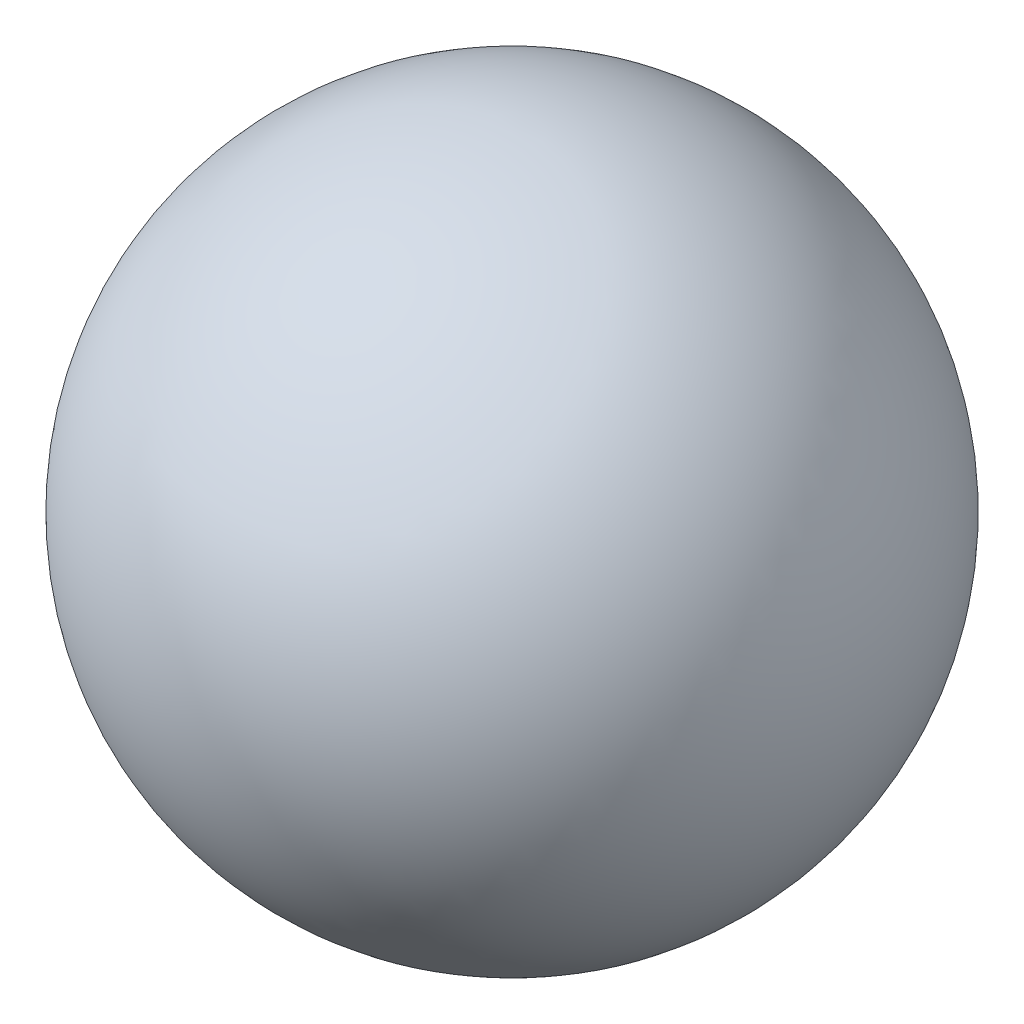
from build123d import *


with BuildPart() as part:
    # Esquisse1 → Base-R_volution (revolve)
    with BuildSketch(Plane.XY):
        with BuildLine():
            Line((0, 2.25), (0, -2.25))
            ThreePointArc((0, -2.25), (-2.25, 0), (0, 2.25))
        make_face()
    revolve(axis=Axis((0, 40, 0), (0, -1, 0)))


solid = part.part
